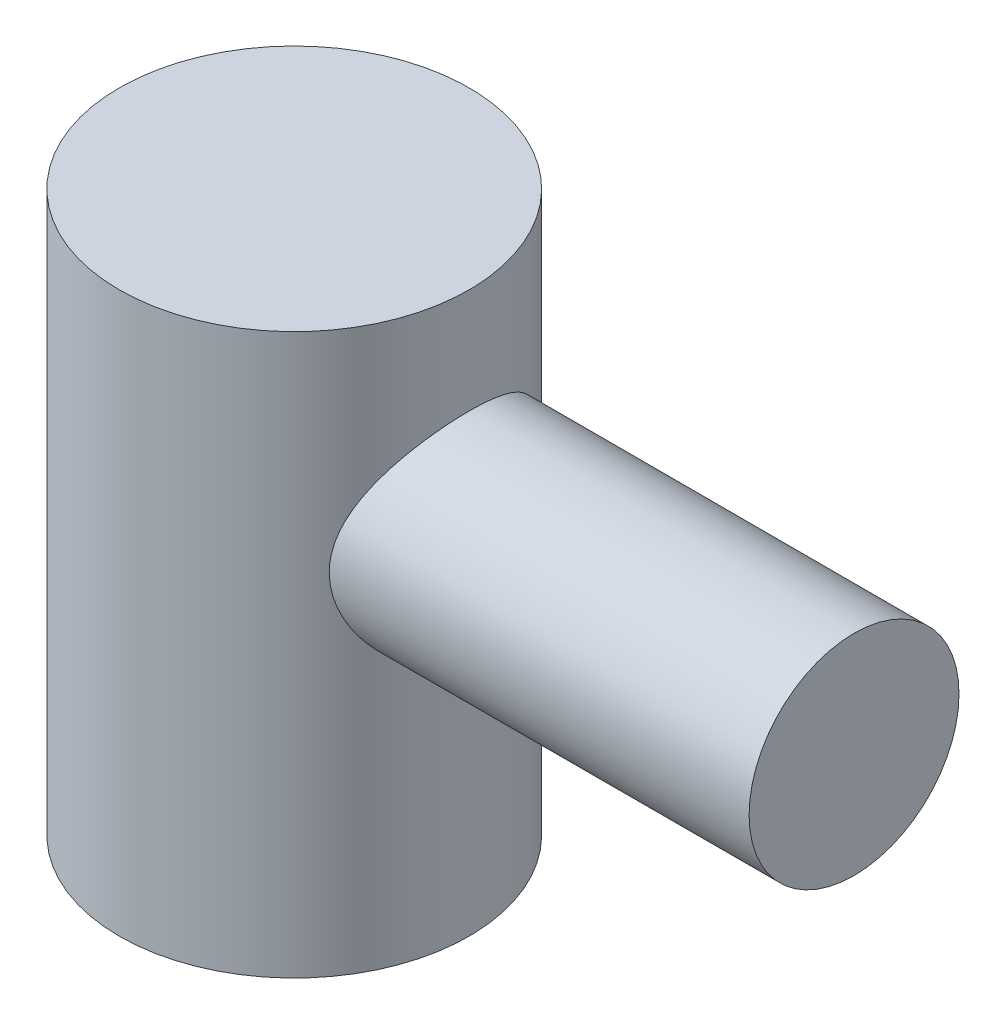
from build123d import *

# Parameters (mm, degrees)
CROQUIS1_R              = 25
SALIENTE_EXTRUIR1_DEPTH = 80
CROQUIS2_R              = 15
SALIENTE_EXTRUIR2_DEPTH = 80


with BuildPart() as part:
    # Croquis1 → Saliente-Extruir1 (new body)
    with BuildSketch(Plane(origin=(0, 0, 0), x_dir=(1, 0, 0), z_dir=(0, 1, 0))):
        with Locations(Location((0, 0, 0), (0, 0, 270))):
            Circle(CROQUIS1_R)
    extrude(amount=SALIENTE_EXTRUIR1_DEPTH)

    # Croquis2 → Saliente-Extruir2 (add)
    with BuildSketch(Plane(origin=(0, 0, 0), x_dir=(0, 0, -1), z_dir=(1, 0, 0))):
        with Locations(Location((0, 50, 0), (0, 0, 180))):
            Circle(CROQUIS2_R)
    extrude(amount=SALIENTE_EXTRUIR2_DEPTH)


solid = part.part
